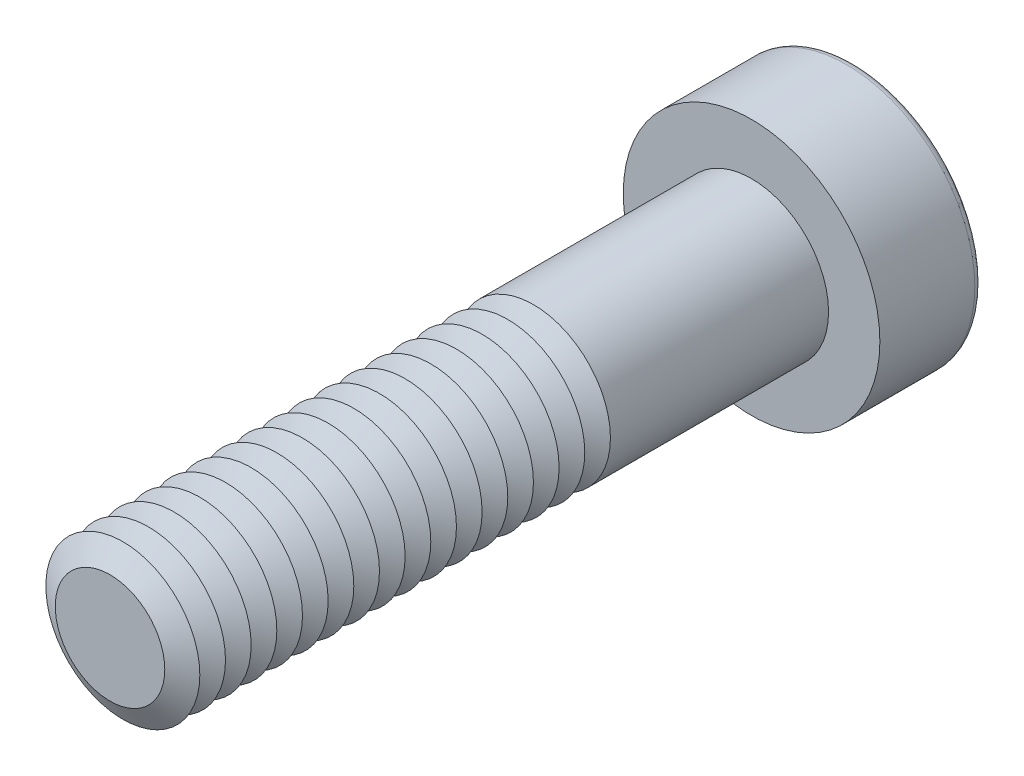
ISO-10303-21;
HEADER;
FILE_DESCRIPTION(('STEP AP214'),'2;1');
FILE_NAME('part.step','',(''),(''),'','','');
FILE_SCHEMA(('AUTOMOTIVE_DESIGN { 1 0 10303 214 1 1 1 1 }'));
ENDSEC;
DATA;
#1=APPLICATION_CONTEXT('core data for automotive mechanical design processes');
#2=APPLICATION_PROTOCOL_DEFINITION('international standard','automotive_design',2000,#1);
#3=PRODUCT_CONTEXT('',#1,'mechanical');
#4=PRODUCT('Part','Part','',(#3));
#5=PRODUCT_RELATED_PRODUCT_CATEGORY('part','',(#4));
#6=PRODUCT_DEFINITION_FORMATION('','',#4);
#7=PRODUCT_DEFINITION_CONTEXT('part definition',#1,'design');
#8=PRODUCT_DEFINITION('design','',#6,#7);
#9=PRODUCT_DEFINITION_SHAPE('','',#8);
#10=(LENGTH_UNIT() NAMED_UNIT(*) SI_UNIT(.MILLI.,.METRE.));
#11=(NAMED_UNIT(*) PLANE_ANGLE_UNIT() SI_UNIT($,.RADIAN.));
#12=(NAMED_UNIT(*) SI_UNIT($,.STERADIAN.) SOLID_ANGLE_UNIT());
#13=UNCERTAINTY_MEASURE_WITH_UNIT(LENGTH_MEASURE(1.E-05),#10,'distance_accuracy_value','');
#14=(GEOMETRIC_REPRESENTATION_CONTEXT(3) GLOBAL_UNCERTAINTY_ASSIGNED_CONTEXT((#13)) GLOBAL_UNIT_ASSIGNED_CONTEXT((#10,
#11,#12)) REPRESENTATION_CONTEXT('',''));
#15=CARTESIAN_POINT('',(0.,0.,0.));
#16=DIRECTION('',(0.,0.,1.));
#17=DIRECTION('',(1.,0.,0.));
#18=AXIS2_PLACEMENT_3D('',#15,#16,#17);
#19=CARTESIAN_POINT('',(0.,0.,21.5));
#20=DIRECTION('',(0.,0.,1.));
#21=DIRECTION('',(1.,0.,0.));
#22=AXIS2_PLACEMENT_3D('',#19,#20,#21);
#23=CONICAL_SURFACE('',#22,3.,1.0471975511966);
#24=CARTESIAN_POINT('',(0.,0.,21.));
#25=DIRECTION('',(0.,0.,1.));
#26=DIRECTION('',(1.,0.,0.));
#27=AXIS2_PLACEMENT_3D('',#24,#25,#26);
#28=CIRCLE('',#27,2.13397459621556);
#29=CARTESIAN_POINT('',(2.13397459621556,0.,21.));
#30=VERTEX_POINT('',#29);
#31=EDGE_CURVE('E313',#30,#30,#28,.T.);
#32=ORIENTED_EDGE('',*,*,#31,.T.);
#33=EDGE_LOOP('',(#32));
#34=FACE_BOUND('',#33,.T.);
#35=CARTESIAN_POINT('',(0.,0.,21.5));
#36=DIRECTION('',(0.,0.,1.));
#37=DIRECTION('',(1.,0.,0.));
#38=AXIS2_PLACEMENT_3D('',#35,#36,#37);
#39=CIRCLE('',#38,3.);
#40=CARTESIAN_POINT('',(3.,0.,21.5));
#41=VERTEX_POINT('',#40);
#42=EDGE_CURVE('E316',#41,#41,#39,.T.);
#43=ORIENTED_EDGE('',*,*,#42,.F.);
#44=EDGE_LOOP('',(#43));
#45=FACE_BOUND('',#44,.T.);
#46=ADVANCED_FACE('F39',(#34,#45),#23,.T.);
#47=CARTESIAN_POINT('',(0.,0.,21.));
#48=DIRECTION('',(0.,0.,-1.));
#49=DIRECTION('',(-1.,0.,0.));
#50=AXIS2_PLACEMENT_3D('',#47,#48,#49);
#51=CONICAL_SURFACE('',#50,2.13397459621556,1.0471975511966);
#52=CARTESIAN_POINT('',(0.,0.,20.5));
#53=DIRECTION('',(0.,0.,1.));
#54=DIRECTION('',(1.,0.,0.));
#55=AXIS2_PLACEMENT_3D('',#52,#53,#54);
#56=CIRCLE('',#55,3.);
#57=CARTESIAN_POINT('',(3.,0.,20.5));
#58=VERTEX_POINT('',#57);
#59=EDGE_CURVE('E324',#58,#58,#56,.T.);
#60=ORIENTED_EDGE('',*,*,#59,.T.);
#61=EDGE_LOOP('',(#60));
#62=FACE_BOUND('',#61,.T.);
#63=ORIENTED_EDGE('',*,*,#31,.F.);
#64=EDGE_LOOP('',(#63));
#65=FACE_BOUND('',#64,.T.);
#66=ADVANCED_FACE('F244',(#62,#65),#51,.T.);
#67=CARTESIAN_POINT('',(0.,0.,25.));
#68=DIRECTION('',(0.,0.,1.));
#69=DIRECTION('',(1.,0.,0.));
#70=AXIS2_PLACEMENT_3D('',#67,#68,#69);
#71=PLANE('',#70);
#72=CARTESIAN_POINT('',(0.,0.,25.));
#73=DIRECTION('',(0.,0.,1.));
#74=DIRECTION('',(1.,0.,0.));
#75=AXIS2_PLACEMENT_3D('',#72,#73,#74);
#76=CIRCLE('',#75,2.13397459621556);
#77=CARTESIAN_POINT('',(2.13397459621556,0.,25.));
#78=VERTEX_POINT('',#77);
#79=EDGE_CURVE('E174',#78,#78,#76,.T.);
#80=ORIENTED_EDGE('',*,*,#79,.T.);
#81=EDGE_LOOP('',(#80));
#82=FACE_BOUND('',#81,.T.);
#83=ADVANCED_FACE('F250',(#82),#71,.T.);
#84=CARTESIAN_POINT('',(0.,0.,25.));
#85=DIRECTION('',(0.,0.,-1.));
#86=DIRECTION('',(-1.,0.,0.));
#87=AXIS2_PLACEMENT_3D('',#84,#85,#86);
#88=CONICAL_SURFACE('',#87,2.13397459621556,1.0471975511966);
#89=CARTESIAN_POINT('',(0.,0.,24.5));
#90=DIRECTION('',(0.,0.,1.));
#91=DIRECTION('',(1.,0.,0.));
#92=AXIS2_PLACEMENT_3D('',#89,#90,#91);
#93=CIRCLE('',#92,3.);
#94=CARTESIAN_POINT('',(3.,0.,24.5));
#95=VERTEX_POINT('',#94);
#96=EDGE_CURVE('E290',#95,#95,#93,.T.);
#97=ORIENTED_EDGE('',*,*,#96,.T.);
#98=EDGE_LOOP('',(#97));
#99=FACE_BOUND('',#98,.T.);
#100=ORIENTED_EDGE('',*,*,#79,.F.);
#101=EDGE_LOOP('',(#100));
#102=FACE_BOUND('',#101,.T.);
#103=ADVANCED_FACE('F198',(#99,#102),#88,.T.);
#104=CARTESIAN_POINT('',(0.,0.,24.5));
#105=DIRECTION('',(0.,0.,1.));
#106=DIRECTION('',(1.,0.,0.));
#107=AXIS2_PLACEMENT_3D('',#104,#105,#106);
#108=CONICAL_SURFACE('',#107,3.,1.0471975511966);
#109=CARTESIAN_POINT('',(0.,0.,24.));
#110=DIRECTION('',(0.,0.,1.));
#111=DIRECTION('',(1.,0.,0.));
#112=AXIS2_PLACEMENT_3D('',#109,#110,#111);
#113=CIRCLE('',#112,2.13397459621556);
#114=CARTESIAN_POINT('',(2.13397459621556,0.,24.));
#115=VERTEX_POINT('',#114);
#116=EDGE_CURVE('E287',#115,#115,#113,.T.);
#117=ORIENTED_EDGE('',*,*,#116,.T.);
#118=EDGE_LOOP('',(#117));
#119=FACE_BOUND('',#118,.T.);
#120=ORIENTED_EDGE('',*,*,#96,.F.);
#121=EDGE_LOOP('',(#120));
#122=FACE_BOUND('',#121,.T.);
#123=ADVANCED_FACE('F276',(#119,#122),#108,.T.);
#124=CARTESIAN_POINT('',(0.,0.,24.));
#125=DIRECTION('',(0.,0.,-1.));
#126=DIRECTION('',(-1.,0.,0.));
#127=AXIS2_PLACEMENT_3D('',#124,#125,#126);
#128=CONICAL_SURFACE('',#127,2.13397459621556,1.0471975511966);
#129=CARTESIAN_POINT('',(0.,0.,23.5));
#130=DIRECTION('',(0.,0.,1.));
#131=DIRECTION('',(1.,0.,0.));
#132=AXIS2_PLACEMENT_3D('',#129,#130,#131);
#133=CIRCLE('',#132,3.);
#134=CARTESIAN_POINT('',(3.,0.,23.5));
#135=VERTEX_POINT('',#134);
#136=EDGE_CURVE('E299',#135,#135,#133,.T.);
#137=ORIENTED_EDGE('',*,*,#136,.T.);
#138=EDGE_LOOP('',(#137));
#139=FACE_BOUND('',#138,.T.);
#140=ORIENTED_EDGE('',*,*,#116,.F.);
#141=EDGE_LOOP('',(#140));
#142=FACE_BOUND('',#141,.T.);
#143=ADVANCED_FACE('F273',(#139,#142),#128,.T.);
#144=CARTESIAN_POINT('',(0.,0.,23.5));
#145=DIRECTION('',(0.,0.,1.));
#146=DIRECTION('',(1.,0.,0.));
#147=AXIS2_PLACEMENT_3D('',#144,#145,#146);
#148=CONICAL_SURFACE('',#147,3.,1.0471975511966);
#149=CARTESIAN_POINT('',(0.,0.,23.));
#150=DIRECTION('',(0.,0.,1.));
#151=DIRECTION('',(1.,0.,0.));
#152=AXIS2_PLACEMENT_3D('',#149,#150,#151);
#153=CIRCLE('',#152,2.13397459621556);
#154=CARTESIAN_POINT('',(2.13397459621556,0.,23.));
#155=VERTEX_POINT('',#154);
#156=EDGE_CURVE('E292',#155,#155,#153,.T.);
#157=ORIENTED_EDGE('',*,*,#156,.T.);
#158=EDGE_LOOP('',(#157));
#159=FACE_BOUND('',#158,.T.);
#160=ORIENTED_EDGE('',*,*,#136,.F.);
#161=EDGE_LOOP('',(#160));
#162=FACE_BOUND('',#161,.T.);
#163=ADVANCED_FACE('F269',(#159,#162),#148,.T.);
#164=CARTESIAN_POINT('',(0.,0.,23.));
#165=DIRECTION('',(0.,0.,-1.));
#166=DIRECTION('',(-1.,0.,0.));
#167=AXIS2_PLACEMENT_3D('',#164,#165,#166);
#168=CONICAL_SURFACE('',#167,2.13397459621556,1.0471975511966);
#169=CARTESIAN_POINT('',(0.,0.,22.5));
#170=DIRECTION('',(0.,0.,1.));
#171=DIRECTION('',(1.,0.,0.));
#172=AXIS2_PLACEMENT_3D('',#169,#170,#171);
#173=CIRCLE('',#172,3.);
#174=CARTESIAN_POINT('',(3.,0.,22.5));
#175=VERTEX_POINT('',#174);
#176=EDGE_CURVE('E309',#175,#175,#173,.T.);
#177=ORIENTED_EDGE('',*,*,#176,.T.);
#178=EDGE_LOOP('',(#177));
#179=FACE_BOUND('',#178,.T.);
#180=ORIENTED_EDGE('',*,*,#156,.F.);
#181=EDGE_LOOP('',(#180));
#182=FACE_BOUND('',#181,.T.);
#183=ADVANCED_FACE('F265',(#179,#182),#168,.T.);
#184=CARTESIAN_POINT('',(0.,0.,22.5));
#185=DIRECTION('',(0.,0.,1.));
#186=DIRECTION('',(1.,0.,0.));
#187=AXIS2_PLACEMENT_3D('',#184,#185,#186);
#188=CONICAL_SURFACE('',#187,3.,1.0471975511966);
#189=CARTESIAN_POINT('',(0.,0.,22.));
#190=DIRECTION('',(0.,0.,1.));
#191=DIRECTION('',(1.,0.,0.));
#192=AXIS2_PLACEMENT_3D('',#189,#190,#191);
#193=CIRCLE('',#192,2.13397459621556);
#194=CARTESIAN_POINT('',(2.13397459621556,0.,22.));
#195=VERTEX_POINT('',#194);
#196=EDGE_CURVE('E305',#195,#195,#193,.T.);
#197=ORIENTED_EDGE('',*,*,#196,.T.);
#198=EDGE_LOOP('',(#197));
#199=FACE_BOUND('',#198,.T.);
#200=ORIENTED_EDGE('',*,*,#176,.F.);
#201=EDGE_LOOP('',(#200));
#202=FACE_BOUND('',#201,.T.);
#203=ADVANCED_FACE('F261',(#199,#202),#188,.T.);
#204=CARTESIAN_POINT('',(0.,0.,22.));
#205=DIRECTION('',(0.,0.,-1.));
#206=DIRECTION('',(-1.,0.,0.));
#207=AXIS2_PLACEMENT_3D('',#204,#205,#206);
#208=CONICAL_SURFACE('',#207,2.13397459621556,1.0471975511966);
#209=ORIENTED_EDGE('',*,*,#42,.T.);
#210=EDGE_LOOP('',(#209));
#211=FACE_BOUND('',#210,.T.);
#212=ORIENTED_EDGE('',*,*,#196,.F.);
#213=EDGE_LOOP('',(#212));
#214=FACE_BOUND('',#213,.T.);
#215=ADVANCED_FACE('F257',(#211,#214),#208,.T.);
#216=CARTESIAN_POINT('',(0.,0.,20.5));
#217=DIRECTION('',(0.,0.,1.));
#218=DIRECTION('',(1.,0.,0.));
#219=AXIS2_PLACEMENT_3D('',#216,#217,#218);
#220=CONICAL_SURFACE('',#219,3.,1.0471975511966);
#221=CARTESIAN_POINT('',(0.,0.,20.));
#222=DIRECTION('',(0.,0.,1.));
#223=DIRECTION('',(1.,0.,0.));
#224=AXIS2_PLACEMENT_3D('',#221,#222,#223);
#225=CIRCLE('',#224,2.13397459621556);
#226=CARTESIAN_POINT('',(2.13397459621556,0.,20.));
#227=VERTEX_POINT('',#226);
#228=EDGE_CURVE('E320',#227,#227,#225,.T.);
#229=ORIENTED_EDGE('',*,*,#228,.T.);
#230=EDGE_LOOP('',(#229));
#231=FACE_BOUND('',#230,.T.);
#232=ORIENTED_EDGE('',*,*,#59,.F.);
#233=EDGE_LOOP('',(#232));
#234=FACE_BOUND('',#233,.T.);
#235=ADVANCED_FACE('F260',(#231,#234),#220,.T.);
#236=CARTESIAN_POINT('',(0.,0.,20.));
#237=DIRECTION('',(0.,0.,-1.));
#238=DIRECTION('',(-1.,0.,0.));
#239=AXIS2_PLACEMENT_3D('',#236,#237,#238);
#240=CONICAL_SURFACE('',#239,2.13397459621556,1.0471975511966);
#241=CARTESIAN_POINT('',(0.,0.,19.5));
#242=DIRECTION('',(0.,0.,1.));
#243=DIRECTION('',(1.,0.,0.));
#244=AXIS2_PLACEMENT_3D('',#241,#242,#243);
#245=CIRCLE('',#244,3.);
#246=CARTESIAN_POINT('',(3.,0.,19.5));
#247=VERTEX_POINT('',#246);
#248=EDGE_CURVE('E331',#247,#247,#245,.T.);
#249=ORIENTED_EDGE('',*,*,#248,.T.);
#250=EDGE_LOOP('',(#249));
#251=FACE_BOUND('',#250,.T.);
#252=ORIENTED_EDGE('',*,*,#228,.F.);
#253=EDGE_LOOP('',(#252));
#254=FACE_BOUND('',#253,.T.);
#255=ADVANCED_FACE('F511',(#251,#254),#240,.T.);
#256=CARTESIAN_POINT('',(0.,0.,19.5));
#257=DIRECTION('',(0.,0.,1.));
#258=DIRECTION('',(1.,0.,0.));
#259=AXIS2_PLACEMENT_3D('',#256,#257,#258);
#260=CONICAL_SURFACE('',#259,3.,1.0471975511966);
#261=CARTESIAN_POINT('',(0.,0.,19.));
#262=DIRECTION('',(0.,0.,1.));
#263=DIRECTION('',(1.,0.,0.));
#264=AXIS2_PLACEMENT_3D('',#261,#262,#263);
#265=CIRCLE('',#264,2.13397459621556);
#266=CARTESIAN_POINT('',(2.13397459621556,0.,19.));
#267=VERTEX_POINT('',#266);
#268=EDGE_CURVE('E327',#267,#267,#265,.T.);
#269=ORIENTED_EDGE('',*,*,#268,.T.);
#270=EDGE_LOOP('',(#269));
#271=FACE_BOUND('',#270,.T.);
#272=ORIENTED_EDGE('',*,*,#248,.F.);
#273=EDGE_LOOP('',(#272));
#274=FACE_BOUND('',#273,.T.);
#275=ADVANCED_FACE('F507',(#271,#274),#260,.T.);
#276=CARTESIAN_POINT('',(0.,0.,19.));
#277=DIRECTION('',(0.,0.,-1.));
#278=DIRECTION('',(-1.,0.,0.));
#279=AXIS2_PLACEMENT_3D('',#276,#277,#278);
#280=CONICAL_SURFACE('',#279,2.13397459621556,1.0471975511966);
#281=CARTESIAN_POINT('',(0.,0.,18.5));
#282=DIRECTION('',(0.,0.,1.));
#283=DIRECTION('',(1.,0.,0.));
#284=AXIS2_PLACEMENT_3D('',#281,#282,#283);
#285=CIRCLE('',#284,3.);
#286=CARTESIAN_POINT('',(3.,0.,18.5));
#287=VERTEX_POINT('',#286);
#288=EDGE_CURVE('E339',#287,#287,#285,.T.);
#289=ORIENTED_EDGE('',*,*,#288,.T.);
#290=EDGE_LOOP('',(#289));
#291=FACE_BOUND('',#290,.T.);
#292=ORIENTED_EDGE('',*,*,#268,.F.);
#293=EDGE_LOOP('',(#292));
#294=FACE_BOUND('',#293,.T.);
#295=ADVANCED_FACE('F503',(#291,#294),#280,.T.);
#296=CARTESIAN_POINT('',(0.,0.,18.5));
#297=DIRECTION('',(0.,0.,1.));
#298=DIRECTION('',(1.,0.,0.));
#299=AXIS2_PLACEMENT_3D('',#296,#297,#298);
#300=CONICAL_SURFACE('',#299,3.,1.0471975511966);
#301=CARTESIAN_POINT('',(0.,0.,18.));
#302=DIRECTION('',(0.,0.,1.));
#303=DIRECTION('',(1.,0.,0.));
#304=AXIS2_PLACEMENT_3D('',#301,#302,#303);
#305=CIRCLE('',#304,2.13397459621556);
#306=CARTESIAN_POINT('',(2.13397459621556,0.,18.));
#307=VERTEX_POINT('',#306);
#308=EDGE_CURVE('E335',#307,#307,#305,.T.);
#309=ORIENTED_EDGE('',*,*,#308,.T.);
#310=EDGE_LOOP('',(#309));
#311=FACE_BOUND('',#310,.T.);
#312=ORIENTED_EDGE('',*,*,#288,.F.);
#313=EDGE_LOOP('',(#312));
#314=FACE_BOUND('',#313,.T.);
#315=ADVANCED_FACE('F499',(#311,#314),#300,.T.);
#316=CARTESIAN_POINT('',(0.,0.,18.));
#317=DIRECTION('',(0.,0.,-1.));
#318=DIRECTION('',(-1.,0.,0.));
#319=AXIS2_PLACEMENT_3D('',#316,#317,#318);
#320=CONICAL_SURFACE('',#319,2.13397459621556,1.0471975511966);
#321=CARTESIAN_POINT('',(0.,0.,17.5));
#322=DIRECTION('',(0.,0.,1.));
#323=DIRECTION('',(1.,0.,0.));
#324=AXIS2_PLACEMENT_3D('',#321,#322,#323);
#325=CIRCLE('',#324,3.);
#326=CARTESIAN_POINT('',(3.,0.,17.5));
#327=VERTEX_POINT('',#326);
#328=EDGE_CURVE('E347',#327,#327,#325,.T.);
#329=ORIENTED_EDGE('',*,*,#328,.T.);
#330=EDGE_LOOP('',(#329));
#331=FACE_BOUND('',#330,.T.);
#332=ORIENTED_EDGE('',*,*,#308,.F.);
#333=EDGE_LOOP('',(#332));
#334=FACE_BOUND('',#333,.T.);
#335=ADVANCED_FACE('F495',(#331,#334),#320,.T.);
#336=CARTESIAN_POINT('',(0.,0.,17.5));
#337=DIRECTION('',(0.,0.,1.));
#338=DIRECTION('',(1.,0.,0.));
#339=AXIS2_PLACEMENT_3D('',#336,#337,#338);
#340=CONICAL_SURFACE('',#339,3.,1.0471975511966);
#341=CARTESIAN_POINT('',(0.,0.,17.));
#342=DIRECTION('',(0.,0.,1.));
#343=DIRECTION('',(1.,0.,0.));
#344=AXIS2_PLACEMENT_3D('',#341,#342,#343);
#345=CIRCLE('',#344,2.13397459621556);
#346=CARTESIAN_POINT('',(2.13397459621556,0.,17.));
#347=VERTEX_POINT('',#346);
#348=EDGE_CURVE('E343',#347,#347,#345,.T.);
#349=ORIENTED_EDGE('',*,*,#348,.T.);
#350=EDGE_LOOP('',(#349));
#351=FACE_BOUND('',#350,.T.);
#352=ORIENTED_EDGE('',*,*,#328,.F.);
#353=EDGE_LOOP('',(#352));
#354=FACE_BOUND('',#353,.T.);
#355=ADVANCED_FACE('F491',(#351,#354),#340,.T.);
#356=CARTESIAN_POINT('',(0.,0.,17.));
#357=DIRECTION('',(0.,0.,-1.));
#358=DIRECTION('',(-1.,0.,0.));
#359=AXIS2_PLACEMENT_3D('',#356,#357,#358);
#360=CONICAL_SURFACE('',#359,2.13397459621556,1.0471975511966);
#361=CARTESIAN_POINT('',(0.,0.,16.5));
#362=DIRECTION('',(0.,0.,1.));
#363=DIRECTION('',(1.,0.,0.));
#364=AXIS2_PLACEMENT_3D('',#361,#362,#363);
#365=CIRCLE('',#364,3.);
#366=CARTESIAN_POINT('',(3.,0.,16.5));
#367=VERTEX_POINT('',#366);
#368=EDGE_CURVE('E355',#367,#367,#365,.T.);
#369=ORIENTED_EDGE('',*,*,#368,.T.);
#370=EDGE_LOOP('',(#369));
#371=FACE_BOUND('',#370,.T.);
#372=ORIENTED_EDGE('',*,*,#348,.F.);
#373=EDGE_LOOP('',(#372));
#374=FACE_BOUND('',#373,.T.);
#375=ADVANCED_FACE('F487',(#371,#374),#360,.T.);
#376=CARTESIAN_POINT('',(0.,0.,16.5));
#377=DIRECTION('',(0.,0.,1.));
#378=DIRECTION('',(1.,0.,0.));
#379=AXIS2_PLACEMENT_3D('',#376,#377,#378);
#380=CONICAL_SURFACE('',#379,3.,1.0471975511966);
#381=CARTESIAN_POINT('',(0.,0.,16.));
#382=DIRECTION('',(0.,0.,1.));
#383=DIRECTION('',(1.,0.,0.));
#384=AXIS2_PLACEMENT_3D('',#381,#382,#383);
#385=CIRCLE('',#384,2.13397459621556);
#386=CARTESIAN_POINT('',(2.13397459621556,0.,16.));
#387=VERTEX_POINT('',#386);
#388=EDGE_CURVE('E351',#387,#387,#385,.T.);
#389=ORIENTED_EDGE('',*,*,#388,.T.);
#390=EDGE_LOOP('',(#389));
#391=FACE_BOUND('',#390,.T.);
#392=ORIENTED_EDGE('',*,*,#368,.F.);
#393=EDGE_LOOP('',(#392));
#394=FACE_BOUND('',#393,.T.);
#395=ADVANCED_FACE('F483',(#391,#394),#380,.T.);
#396=CARTESIAN_POINT('',(0.,0.,16.));
#397=DIRECTION('',(0.,0.,-1.));
#398=DIRECTION('',(-1.,0.,0.));
#399=AXIS2_PLACEMENT_3D('',#396,#397,#398);
#400=CONICAL_SURFACE('',#399,2.13397459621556,1.0471975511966);
#401=CARTESIAN_POINT('',(0.,0.,15.5));
#402=DIRECTION('',(0.,0.,1.));
#403=DIRECTION('',(1.,0.,0.));
#404=AXIS2_PLACEMENT_3D('',#401,#402,#403);
#405=CIRCLE('',#404,3.);
#406=CARTESIAN_POINT('',(3.,0.,15.5));
#407=VERTEX_POINT('',#406);
#408=EDGE_CURVE('E363',#407,#407,#405,.T.);
#409=ORIENTED_EDGE('',*,*,#408,.T.);
#410=EDGE_LOOP('',(#409));
#411=FACE_BOUND('',#410,.T.);
#412=ORIENTED_EDGE('',*,*,#388,.F.);
#413=EDGE_LOOP('',(#412));
#414=FACE_BOUND('',#413,.T.);
#415=ADVANCED_FACE('F479',(#411,#414),#400,.T.);
#416=CARTESIAN_POINT('',(0.,0.,15.5));
#417=DIRECTION('',(0.,0.,1.));
#418=DIRECTION('',(1.,0.,0.));
#419=AXIS2_PLACEMENT_3D('',#416,#417,#418);
#420=CONICAL_SURFACE('',#419,3.,1.0471975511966);
#421=CARTESIAN_POINT('',(0.,0.,15.));
#422=DIRECTION('',(0.,0.,1.));
#423=DIRECTION('',(1.,0.,0.));
#424=AXIS2_PLACEMENT_3D('',#421,#422,#423);
#425=CIRCLE('',#424,2.13397459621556);
#426=CARTESIAN_POINT('',(2.13397459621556,0.,15.));
#427=VERTEX_POINT('',#426);
#428=EDGE_CURVE('E359',#427,#427,#425,.T.);
#429=ORIENTED_EDGE('',*,*,#428,.T.);
#430=EDGE_LOOP('',(#429));
#431=FACE_BOUND('',#430,.T.);
#432=ORIENTED_EDGE('',*,*,#408,.F.);
#433=EDGE_LOOP('',(#432));
#434=FACE_BOUND('',#433,.T.);
#435=ADVANCED_FACE('F475',(#431,#434),#420,.T.);
#436=CARTESIAN_POINT('',(0.,0.,15.));
#437=DIRECTION('',(0.,0.,-1.));
#438=DIRECTION('',(-1.,0.,0.));
#439=AXIS2_PLACEMENT_3D('',#436,#437,#438);
#440=CONICAL_SURFACE('',#439,2.13397459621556,1.0471975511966);
#441=CARTESIAN_POINT('',(0.,0.,14.5));
#442=DIRECTION('',(0.,0.,1.));
#443=DIRECTION('',(1.,0.,0.));
#444=AXIS2_PLACEMENT_3D('',#441,#442,#443);
#445=CIRCLE('',#444,3.);
#446=CARTESIAN_POINT('',(3.,0.,14.5));
#447=VERTEX_POINT('',#446);
#448=EDGE_CURVE('E371',#447,#447,#445,.T.);
#449=ORIENTED_EDGE('',*,*,#448,.T.);
#450=EDGE_LOOP('',(#449));
#451=FACE_BOUND('',#450,.T.);
#452=ORIENTED_EDGE('',*,*,#428,.F.);
#453=EDGE_LOOP('',(#452));
#454=FACE_BOUND('',#453,.T.);
#455=ADVANCED_FACE('F471',(#451,#454),#440,.T.);
#456=CARTESIAN_POINT('',(0.,0.,14.5));
#457=DIRECTION('',(0.,0.,1.));
#458=DIRECTION('',(1.,0.,0.));
#459=AXIS2_PLACEMENT_3D('',#456,#457,#458);
#460=CONICAL_SURFACE('',#459,3.,1.0471975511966);
#461=CARTESIAN_POINT('',(0.,0.,14.));
#462=DIRECTION('',(0.,0.,1.));
#463=DIRECTION('',(1.,0.,0.));
#464=AXIS2_PLACEMENT_3D('',#461,#462,#463);
#465=CIRCLE('',#464,2.13397459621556);
#466=CARTESIAN_POINT('',(2.13397459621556,0.,14.));
#467=VERTEX_POINT('',#466);
#468=EDGE_CURVE('E367',#467,#467,#465,.T.);
#469=ORIENTED_EDGE('',*,*,#468,.T.);
#470=EDGE_LOOP('',(#469));
#471=FACE_BOUND('',#470,.T.);
#472=ORIENTED_EDGE('',*,*,#448,.F.);
#473=EDGE_LOOP('',(#472));
#474=FACE_BOUND('',#473,.T.);
#475=ADVANCED_FACE('F467',(#471,#474),#460,.T.);
#476=CARTESIAN_POINT('',(0.,0.,14.));
#477=DIRECTION('',(0.,0.,-1.));
#478=DIRECTION('',(-1.,0.,0.));
#479=AXIS2_PLACEMENT_3D('',#476,#477,#478);
#480=CONICAL_SURFACE('',#479,2.13397459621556,1.0471975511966);
#481=CARTESIAN_POINT('',(0.,0.,13.5));
#482=DIRECTION('',(0.,0.,1.));
#483=DIRECTION('',(1.,0.,0.));
#484=AXIS2_PLACEMENT_3D('',#481,#482,#483);
#485=CIRCLE('',#484,3.);
#486=CARTESIAN_POINT('',(3.,0.,13.5));
#487=VERTEX_POINT('',#486);
#488=EDGE_CURVE('E379',#487,#487,#485,.T.);
#489=ORIENTED_EDGE('',*,*,#488,.T.);
#490=EDGE_LOOP('',(#489));
#491=FACE_BOUND('',#490,.T.);
#492=ORIENTED_EDGE('',*,*,#468,.F.);
#493=EDGE_LOOP('',(#492));
#494=FACE_BOUND('',#493,.T.);
#495=ADVANCED_FACE('F463',(#491,#494),#480,.T.);
#496=CARTESIAN_POINT('',(0.,0.,13.5));
#497=DIRECTION('',(0.,0.,1.));
#498=DIRECTION('',(1.,0.,0.));
#499=AXIS2_PLACEMENT_3D('',#496,#497,#498);
#500=CONICAL_SURFACE('',#499,3.,1.0471975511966);
#501=CARTESIAN_POINT('',(0.,0.,13.));
#502=DIRECTION('',(0.,0.,1.));
#503=DIRECTION('',(1.,0.,0.));
#504=AXIS2_PLACEMENT_3D('',#501,#502,#503);
#505=CIRCLE('',#504,2.13397459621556);
#506=CARTESIAN_POINT('',(2.13397459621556,0.,13.));
#507=VERTEX_POINT('',#506);
#508=EDGE_CURVE('E375',#507,#507,#505,.T.);
#509=ORIENTED_EDGE('',*,*,#508,.T.);
#510=EDGE_LOOP('',(#509));
#511=FACE_BOUND('',#510,.T.);
#512=ORIENTED_EDGE('',*,*,#488,.F.);
#513=EDGE_LOOP('',(#512));
#514=FACE_BOUND('',#513,.T.);
#515=ADVANCED_FACE('F459',(#511,#514),#500,.T.);
#516=CARTESIAN_POINT('',(0.,0.,13.));
#517=DIRECTION('',(0.,0.,-1.));
#518=DIRECTION('',(-1.,0.,0.));
#519=AXIS2_PLACEMENT_3D('',#516,#517,#518);
#520=CONICAL_SURFACE('',#519,2.13397459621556,1.0471975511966);
#521=CARTESIAN_POINT('',(0.,0.,12.5));
#522=DIRECTION('',(0.,0.,1.));
#523=DIRECTION('',(1.,0.,0.));
#524=AXIS2_PLACEMENT_3D('',#521,#522,#523);
#525=CIRCLE('',#524,3.);
#526=CARTESIAN_POINT('',(3.,0.,12.5));
#527=VERTEX_POINT('',#526);
#528=EDGE_CURVE('E386',#527,#527,#525,.T.);
#529=ORIENTED_EDGE('',*,*,#528,.T.);
#530=EDGE_LOOP('',(#529));
#531=FACE_BOUND('',#530,.T.);
#532=ORIENTED_EDGE('',*,*,#508,.F.);
#533=EDGE_LOOP('',(#532));
#534=FACE_BOUND('',#533,.T.);
#535=ADVANCED_FACE('F455',(#531,#534),#520,.T.);
#536=CARTESIAN_POINT('',(0.,0.,12.5));
#537=DIRECTION('',(0.,0.,1.));
#538=DIRECTION('',(1.,0.,0.));
#539=AXIS2_PLACEMENT_3D('',#536,#537,#538);
#540=CONICAL_SURFACE('',#539,3.,1.0471975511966);
#541=CARTESIAN_POINT('',(0.,0.,12.));
#542=DIRECTION('',(0.,0.,1.));
#543=DIRECTION('',(1.,0.,0.));
#544=AXIS2_PLACEMENT_3D('',#541,#542,#543);
#545=CIRCLE('',#544,2.13397459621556);
#546=CARTESIAN_POINT('',(2.13397459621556,0.,12.));
#547=VERTEX_POINT('',#546);
#548=EDGE_CURVE('E383',#547,#547,#545,.T.);
#549=ORIENTED_EDGE('',*,*,#548,.T.);
#550=EDGE_LOOP('',(#549));
#551=FACE_BOUND('',#550,.T.);
#552=ORIENTED_EDGE('',*,*,#528,.F.);
#553=EDGE_LOOP('',(#552));
#554=FACE_BOUND('',#553,.T.);
#555=ADVANCED_FACE('F451',(#551,#554),#540,.T.);
#556=CARTESIAN_POINT('',(0.,0.,12.));
#557=DIRECTION('',(0.,0.,-1.));
#558=DIRECTION('',(-1.,0.,0.));
#559=AXIS2_PLACEMENT_3D('',#556,#557,#558);
#560=CONICAL_SURFACE('',#559,2.13397459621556,1.0471975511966);
#561=CARTESIAN_POINT('',(0.,0.,11.5));
#562=DIRECTION('',(0.,0.,1.));
#563=DIRECTION('',(1.,0.,0.));
#564=AXIS2_PLACEMENT_3D('',#561,#562,#563);
#565=CIRCLE('',#564,3.);
#566=CARTESIAN_POINT('',(3.,0.,11.5));
#567=VERTEX_POINT('',#566);
#568=EDGE_CURVE('E394',#567,#567,#565,.T.);
#569=ORIENTED_EDGE('',*,*,#568,.T.);
#570=EDGE_LOOP('',(#569));
#571=FACE_BOUND('',#570,.T.);
#572=ORIENTED_EDGE('',*,*,#548,.F.);
#573=EDGE_LOOP('',(#572));
#574=FACE_BOUND('',#573,.T.);
#575=ADVANCED_FACE('F447',(#571,#574),#560,.T.);
#576=CARTESIAN_POINT('',(0.,0.,11.5));
#577=DIRECTION('',(0.,0.,1.));
#578=DIRECTION('',(1.,0.,0.));
#579=AXIS2_PLACEMENT_3D('',#576,#577,#578);
#580=CONICAL_SURFACE('',#579,3.,1.0471975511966);
#581=CARTESIAN_POINT('',(0.,0.,11.));
#582=DIRECTION('',(0.,0.,1.));
#583=DIRECTION('',(1.,0.,0.));
#584=AXIS2_PLACEMENT_3D('',#581,#582,#583);
#585=CIRCLE('',#584,2.13397459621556);
#586=CARTESIAN_POINT('',(2.13397459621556,0.,11.));
#587=VERTEX_POINT('',#586);
#588=EDGE_CURVE('E390',#587,#587,#585,.T.);
#589=ORIENTED_EDGE('',*,*,#588,.T.);
#590=EDGE_LOOP('',(#589));
#591=FACE_BOUND('',#590,.T.);
#592=ORIENTED_EDGE('',*,*,#568,.F.);
#593=EDGE_LOOP('',(#592));
#594=FACE_BOUND('',#593,.T.);
#595=ADVANCED_FACE('F443',(#591,#594),#580,.T.);
#596=CARTESIAN_POINT('',(0.,0.,11.));
#597=DIRECTION('',(0.,0.,-1.));
#598=DIRECTION('',(-1.,0.,0.));
#599=AXIS2_PLACEMENT_3D('',#596,#597,#598);
#600=CONICAL_SURFACE('',#599,2.13397459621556,1.0471975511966);
#601=CARTESIAN_POINT('',(0.,0.,10.5));
#602=DIRECTION('',(0.,0.,1.));
#603=DIRECTION('',(1.,0.,0.));
#604=AXIS2_PLACEMENT_3D('',#601,#602,#603);
#605=CIRCLE('',#604,3.);
#606=CARTESIAN_POINT('',(3.,0.,10.5));
#607=VERTEX_POINT('',#606);
#608=EDGE_CURVE('E402',#607,#607,#605,.T.);
#609=ORIENTED_EDGE('',*,*,#608,.T.);
#610=EDGE_LOOP('',(#609));
#611=FACE_BOUND('',#610,.T.);
#612=ORIENTED_EDGE('',*,*,#588,.F.);
#613=EDGE_LOOP('',(#612));
#614=FACE_BOUND('',#613,.T.);
#615=ADVANCED_FACE('F439',(#611,#614),#600,.T.);
#616=CARTESIAN_POINT('',(0.,0.,10.5));
#617=DIRECTION('',(0.,0.,1.));
#618=DIRECTION('',(1.,0.,0.));
#619=AXIS2_PLACEMENT_3D('',#616,#617,#618);
#620=CONICAL_SURFACE('',#619,3.,1.0471975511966);
#621=CARTESIAN_POINT('',(0.,0.,10.));
#622=DIRECTION('',(0.,0.,1.));
#623=DIRECTION('',(1.,0.,0.));
#624=AXIS2_PLACEMENT_3D('',#621,#622,#623);
#625=CIRCLE('',#624,2.13397459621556);
#626=CARTESIAN_POINT('',(2.13397459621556,0.,10.));
#627=VERTEX_POINT('',#626);
#628=EDGE_CURVE('E398',#627,#627,#625,.T.);
#629=ORIENTED_EDGE('',*,*,#628,.T.);
#630=EDGE_LOOP('',(#629));
#631=FACE_BOUND('',#630,.T.);
#632=ORIENTED_EDGE('',*,*,#608,.F.);
#633=EDGE_LOOP('',(#632));
#634=FACE_BOUND('',#633,.T.);
#635=ADVANCED_FACE('F434',(#631,#634),#620,.T.);
#636=CARTESIAN_POINT('',(0.,0.,10.));
#637=DIRECTION('',(0.,0.,-1.));
#638=DIRECTION('',(-1.,0.,0.));
#639=AXIS2_PLACEMENT_3D('',#636,#637,#638);
#640=CONICAL_SURFACE('',#639,2.13397459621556,1.0471975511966);
#641=CARTESIAN_POINT('',(0.,0.,9.5));
#642=DIRECTION('',(0.,0.,1.));
#643=DIRECTION('',(1.,0.,0.));
#644=AXIS2_PLACEMENT_3D('',#641,#642,#643);
#645=CIRCLE('',#644,3.);
#646=CARTESIAN_POINT('',(3.,0.,9.5));
#647=VERTEX_POINT('',#646);
#648=EDGE_CURVE('E414',#647,#647,#645,.T.);
#649=ORIENTED_EDGE('',*,*,#648,.T.);
#650=EDGE_LOOP('',(#649));
#651=FACE_BOUND('',#650,.T.);
#652=ORIENTED_EDGE('',*,*,#628,.F.);
#653=EDGE_LOOP('',(#652));
#654=FACE_BOUND('',#653,.T.);
#655=ADVANCED_FACE('F420',(#651,#654),#640,.T.);
#656=CARTESIAN_POINT('',(0.,0.,9.5));
#657=DIRECTION('',(0.,0.,1.));
#658=DIRECTION('',(1.,0.,0.));
#659=AXIS2_PLACEMENT_3D('',#656,#657,#658);
#660=CONICAL_SURFACE('',#659,3.,1.0471975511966);
#661=CARTESIAN_POINT('',(0.,0.,9.));
#662=DIRECTION('',(0.,0.,1.));
#663=DIRECTION('',(1.,0.,0.));
#664=AXIS2_PLACEMENT_3D('',#661,#662,#663);
#665=CIRCLE('',#664,2.13397459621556);
#666=CARTESIAN_POINT('',(2.13397459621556,0.,9.));
#667=VERTEX_POINT('',#666);
#668=EDGE_CURVE('E406',#667,#667,#665,.T.);
#669=ORIENTED_EDGE('',*,*,#668,.T.);
#670=EDGE_LOOP('',(#669));
#671=FACE_BOUND('',#670,.T.);
#672=ORIENTED_EDGE('',*,*,#648,.F.);
#673=EDGE_LOOP('',(#672));
#674=FACE_BOUND('',#673,.T.);
#675=ADVANCED_FACE('F423',(#671,#674),#660,.T.);
#676=CARTESIAN_POINT('',(0.,0.,9.));
#677=DIRECTION('',(0.,0.,-1.));
#678=DIRECTION('',(-1.,0.,0.));
#679=AXIS2_PLACEMENT_3D('',#676,#677,#678);
#680=CONICAL_SURFACE('',#679,2.13397459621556,1.0471975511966);
#681=CARTESIAN_POINT('',(0.,0.,8.5));
#682=DIRECTION('',(0.,0.,1.));
#683=DIRECTION('',(1.,0.,0.));
#684=AXIS2_PLACEMENT_3D('',#681,#682,#683);
#685=CIRCLE('',#684,3.);
#686=CARTESIAN_POINT('',(3.,0.,8.5));
#687=VERTEX_POINT('',#686);
#688=EDGE_CURVE('E410',#687,#687,#685,.T.);
#689=ORIENTED_EDGE('',*,*,#688,.T.);
#690=EDGE_LOOP('',(#689));
#691=FACE_BOUND('',#690,.T.);
#692=ORIENTED_EDGE('',*,*,#668,.F.);
#693=EDGE_LOOP('',(#692));
#694=FACE_BOUND('',#693,.T.);
#695=ADVANCED_FACE('F425',(#691,#694),#680,.T.);
#696=CARTESIAN_POINT('',(0.,0.,-1.));
#697=DIRECTION('',(0.,0.,-1.));
#698=DIRECTION('',(-1.,0.,0.));
#699=AXIS2_PLACEMENT_3D('',#696,#697,#698);
#700=CONICAL_SURFACE('',#699,2.,1.0471975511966);
#701=CARTESIAN_POINT('',(0.,0.,0.154700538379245));
#702=VERTEX_POINT('',#701);
#703=VERTEX_LOOP('',#702);
#704=FACE_BOUND('',#703,.T.);
#705=CARTESIAN_POINT('',(0.,0.,-1.));
#706=DIRECTION('',(0.,0.,-1.));
#707=DIRECTION('',(-1.,0.,0.));
#708=AXIS2_PLACEMENT_3D('',#705,#706,#707);
#709=CIRCLE('',#708,2.);
#710=CARTESIAN_POINT('',(-1.73205080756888,0.999999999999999,-1.));
#711=VERTEX_POINT('',#710);
#712=CARTESIAN_POINT('',(0.,2.,-1.));
#713=VERTEX_POINT('',#712);
#714=EDGE_CURVE('E149',#711,#713,#709,.T.);
#715=ORIENTED_EDGE('',*,*,#714,.T.);
#716=CARTESIAN_POINT('',(0.,0.,-1.));
#717=DIRECTION('',(0.,0.,-1.));
#718=DIRECTION('',(-1.,0.,0.));
#719=AXIS2_PLACEMENT_3D('',#716,#717,#718);
#720=CIRCLE('',#719,2.);
#721=CARTESIAN_POINT('',(1.73205080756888,1.,-1.));
#722=VERTEX_POINT('',#721);
#723=EDGE_CURVE('E54',#713,#722,#720,.T.);
#724=ORIENTED_EDGE('',*,*,#723,.T.);
#725=CARTESIAN_POINT('',(1.73205080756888,-0.999999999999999,-1.));
#726=VERTEX_POINT('',#725);
#727=EDGE_CURVE('E1027',#722,#726,#720,.T.);
#728=ORIENTED_EDGE('',*,*,#727,.T.);
#729=CARTESIAN_POINT('',(0.,-2.,-1.));
#730=VERTEX_POINT('',#729);
#731=EDGE_CURVE('E1025',#726,#730,#720,.T.);
#732=ORIENTED_EDGE('',*,*,#731,.T.);
#733=CARTESIAN_POINT('',(-1.73205080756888,-0.999999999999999,-1.));
#734=VERTEX_POINT('',#733);
#735=EDGE_CURVE('E1018',#730,#734,#720,.T.);
#736=ORIENTED_EDGE('',*,*,#735,.T.);
#737=EDGE_CURVE('E1016',#734,#711,#720,.T.);
#738=ORIENTED_EDGE('',*,*,#737,.T.);
#739=EDGE_LOOP('',(#715,#724,#728,#732,#736,#738));
#740=FACE_BOUND('',#739,.T.);
#741=ADVANCED_FACE('F200',(#704,#740),#700,.F.);
#742=CARTESIAN_POINT('',(0.,0.,-1.));
#743=DIRECTION('',(0.,0.,-1.));
#744=DIRECTION('',(-1.,0.,0.));
#745=AXIS2_PLACEMENT_3D('',#742,#743,#744);
#746=PLANE('',#745);
#747=ORIENTED_EDGE('',*,*,#723,.F.);
#748=DIRECTION('',(1.,0.,0.));
#749=VECTOR('',#748,1.);
#750=CARTESIAN_POINT('',(-1.15470053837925,2.,-1.));
#751=LINE('',#750,#749);
#752=CARTESIAN_POINT('',(1.15470053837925,2.,-1.));
#753=VERTEX_POINT('',#752);
#754=EDGE_CURVE('E1065',#713,#753,#751,.T.);
#755=ORIENTED_EDGE('',*,*,#754,.T.);
#756=DIRECTION('',(0.5,-0.866025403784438,0.));
#757=VECTOR('',#756,1.);
#758=CARTESIAN_POINT('',(1.15470053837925,2.,-1.));
#759=LINE('',#758,#757);
#760=EDGE_CURVE('E155',#753,#722,#759,.T.);
#761=ORIENTED_EDGE('',*,*,#760,.T.);
#762=EDGE_LOOP('',(#747,#755,#761));
#763=FACE_BOUND('',#762,.T.);
#764=ADVANCED_FACE('F606',(#763),#746,.T.);
#765=ORIENTED_EDGE('',*,*,#727,.F.);
#766=CARTESIAN_POINT('',(2.3094010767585,0.,-1.));
#767=VERTEX_POINT('',#766);
#768=EDGE_CURVE('E1068',#722,#767,#759,.T.);
#769=ORIENTED_EDGE('',*,*,#768,.T.);
#770=DIRECTION('',(-0.5,-0.866025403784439,0.));
#771=VECTOR('',#770,1.);
#772=CARTESIAN_POINT('',(2.3094010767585,0.,-1.));
#773=LINE('',#772,#771);
#774=EDGE_CURVE('E1038',#767,#726,#773,.T.);
#775=ORIENTED_EDGE('',*,*,#774,.T.);
#776=EDGE_LOOP('',(#765,#769,#775));
#777=FACE_BOUND('',#776,.T.);
#778=ADVANCED_FACE('F616',(#777),#746,.T.);
#779=ORIENTED_EDGE('',*,*,#731,.F.);
#780=CARTESIAN_POINT('',(1.15470053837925,-2.,-1.));
#781=VERTEX_POINT('',#780);
#782=EDGE_CURVE('E1040',#726,#781,#773,.T.);
#783=ORIENTED_EDGE('',*,*,#782,.T.);
#784=DIRECTION('',(-1.,0.,0.));
#785=VECTOR('',#784,1.);
#786=CARTESIAN_POINT('',(1.15470053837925,-2.,-1.));
#787=LINE('',#786,#785);
#788=EDGE_CURVE('E992',#781,#730,#787,.T.);
#789=ORIENTED_EDGE('',*,*,#788,.T.);
#790=EDGE_LOOP('',(#779,#783,#789));
#791=FACE_BOUND('',#790,.T.);
#792=ADVANCED_FACE('F626',(#791),#746,.T.);
#793=ORIENTED_EDGE('',*,*,#735,.F.);
#794=CARTESIAN_POINT('',(-1.15470053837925,-2.,-1.));
#795=VERTEX_POINT('',#794);
#796=EDGE_CURVE('E1034',#730,#795,#787,.T.);
#797=ORIENTED_EDGE('',*,*,#796,.T.);
#798=DIRECTION('',(-0.5,0.866025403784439,0.));
#799=VECTOR('',#798,1.);
#800=CARTESIAN_POINT('',(-1.15470053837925,-2.,-1.));
#801=LINE('',#800,#799);
#802=EDGE_CURVE('E1036',#795,#734,#801,.T.);
#803=ORIENTED_EDGE('',*,*,#802,.T.);
#804=EDGE_LOOP('',(#793,#797,#803));
#805=FACE_BOUND('',#804,.T.);
#806=ADVANCED_FACE('F634',(#805),#746,.T.);
#807=ORIENTED_EDGE('',*,*,#737,.F.);
#808=CARTESIAN_POINT('',(-2.3094010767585,0.,-1.));
#809=VERTEX_POINT('',#808);
#810=EDGE_CURVE('E1042',#734,#809,#801,.T.);
#811=ORIENTED_EDGE('',*,*,#810,.T.);
#812=DIRECTION('',(0.5,0.866025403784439,0.));
#813=VECTOR('',#812,1.);
#814=CARTESIAN_POINT('',(-2.3094010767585,0.,-1.));
#815=LINE('',#814,#813);
#816=EDGE_CURVE('E158',#809,#711,#815,.T.);
#817=ORIENTED_EDGE('',*,*,#816,.T.);
#818=EDGE_LOOP('',(#807,#811,#817));
#819=FACE_BOUND('',#818,.T.);
#820=ADVANCED_FACE('F230',(#819),#746,.T.);
#821=ORIENTED_EDGE('',*,*,#714,.F.);
#822=CARTESIAN_POINT('',(-1.15470053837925,2.,-1.));
#823=VERTEX_POINT('',#822);
#824=EDGE_CURVE('E1049',#711,#823,#815,.T.);
#825=ORIENTED_EDGE('',*,*,#824,.T.);
#826=EDGE_CURVE('E1063',#823,#713,#751,.T.);
#827=ORIENTED_EDGE('',*,*,#826,.T.);
#828=EDGE_LOOP('',(#821,#825,#827));
#829=FACE_BOUND('',#828,.T.);
#830=ADVANCED_FACE('F618',(#829),#746,.T.);
#831=CARTESIAN_POINT('',(-1.15470053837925,2.,-1.));
#832=DIRECTION('',(0.,1.,0.));
#833=DIRECTION('',(0.,0.,1.));
#834=AXIS2_PLACEMENT_3D('',#831,#832,#833);
#835=PLANE('',#834);
#836=DIRECTION('',(0.,0.,-1.));
#837=VECTOR('',#836,1.);
#838=CARTESIAN_POINT('',(-1.15470053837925,2.,-1.));
#839=LINE('',#838,#837);
#840=CARTESIAN_POINT('',(-1.15470053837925,2.,-4.));
#841=VERTEX_POINT('',#840);
#842=EDGE_CURVE('E147',#823,#841,#839,.T.);
#843=ORIENTED_EDGE('',*,*,#842,.T.);
#844=CARTESIAN_POINT('',(-3.01440758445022,2.,-4.35051689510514));
#845=CARTESIAN_POINT('',(-2.92409762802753,2.,-4.33035636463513));
#846=CARTESIAN_POINT('',(-2.83373054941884,2.,-4.31045254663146));
#847=CARTESIAN_POINT('',(-2.65285291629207,2.,-4.27128852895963));
#848=CARTESIAN_POINT('',(-2.562342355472,2.,-4.25202835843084));
#849=CARTESIAN_POINT('',(-2.29037985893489,2.,-4.19537300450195));
#850=CARTESIAN_POINT('',(-2.10868043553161,2.,-4.15914446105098));
#851=CARTESIAN_POINT('',(-1.74597297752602,2.,-4.09171688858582));
#852=CARTESIAN_POINT('',(-1.56497266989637,2.,-4.06047686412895));
#853=CARTESIAN_POINT('',(-1.20186568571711,2.,-4.00513826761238));
#854=CARTESIAN_POINT('',(-1.01975924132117,2.,-3.98103824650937));
#855=CARTESIAN_POINT('',(-0.744747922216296,2.,-3.9525901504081));
#856=CARTESIAN_POINT('',(-0.652245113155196,2.,-3.9443671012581));
#857=CARTESIAN_POINT('',(-0.467020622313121,2.,-3.93099406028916));
#858=CARTESIAN_POINT('',(-0.374298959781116,2.,-3.92584380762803));
#859=CARTESIAN_POINT('',(-0.188764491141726,2.,-3.91891540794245));
#860=CARTESIAN_POINT('',(-0.0959517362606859,2.,-3.91713591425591));
#861=CARTESIAN_POINT('',(0.0896753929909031,2.,-3.91705786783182));
#862=CARTESIAN_POINT('',(0.182489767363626,2.,-3.91875932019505));
#863=CARTESIAN_POINT('',(0.368369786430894,2.,-3.92554892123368));
#864=CARTESIAN_POINT('',(0.461434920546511,2.,-3.93065079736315));
#865=CARTESIAN_POINT('',(0.647346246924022,2.,-3.94395663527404));
#866=CARTESIAN_POINT('',(0.740192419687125,2.,-3.95216086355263));
#867=CARTESIAN_POINT('',(1.01841374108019,2.,-3.98081777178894));
#868=CARTESIAN_POINT('',(1.2033713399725,2.,-4.00531018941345));
#869=CARTESIAN_POINT('',(1.57694396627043,2.,-4.06236202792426));
#870=CARTESIAN_POINT('',(1.76552771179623,2.,-4.09511615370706));
#871=CARTESIAN_POINT('',(2.14178491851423,2.,-4.1655706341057));
#872=CARTESIAN_POINT('',(2.32945822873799,2.,-4.20327178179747));
#873=CARTESIAN_POINT('',(2.70417911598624,2.,-4.28188312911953));
#874=CARTESIAN_POINT('',(2.89122649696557,2.,-4.32279425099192));
#875=CARTESIAN_POINT('',(3.26484478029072,2.,-4.40674298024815));
#876=CARTESIAN_POINT('',(3.45141567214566,2.,-4.44978063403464));
#877=CARTESIAN_POINT('',(3.821938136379,2.,-4.53678178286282));
#878=CARTESIAN_POINT('',(4.00589388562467,2.,-4.58072756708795));
#879=CARTESIAN_POINT('',(4.37356350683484,2.,-4.66963526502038));
#880=CARTESIAN_POINT('',(4.55727737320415,2.,-4.71459720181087));
#881=CARTESIAN_POINT('',(4.9242660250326,2.,-4.80519833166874));
#882=CARTESIAN_POINT('',(5.10754106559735,2.,-4.85083649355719));
#883=CARTESIAN_POINT('',(5.47394280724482,2.,-4.94267693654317));
#884=CARTESIAN_POINT('',(5.65706951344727,2.,-4.98887919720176));
#885=CARTESIAN_POINT('',(5.84014583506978,2.,-5.03527803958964));
#886=B_SPLINE_CURVE_WITH_KNOTS('',3,(#844,#845,#846,#847,#848,#849,#850,#851,#852,#853,#854,
#855,#856,#857,#858,#859,#860,#861,#862,#863,#864,#865,#866,#867,#868,#869,#870,#871,#872,#873,
#874,#875,#876,#877,#878,#879,#880,#881,#882,#883,#884,#885),.UNSPECIFIED.,.F.,.F.,(4,2,2,2,2,2,
2,2,2,2,2,2,2,2,2,2,2,2,2,2,4),(0.,0.277597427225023,0.555207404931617,1.11099118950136,
1.66194208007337,2.21278108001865,2.49134108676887,2.76987744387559,3.04830249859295,
3.32672796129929,3.60628428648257,3.88586463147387,4.44532615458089,5.0194589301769,
5.59368385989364,6.16807437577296,6.74247743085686,7.30986991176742,7.87727529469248,
8.44388991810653,9.01048407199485),.UNSPECIFIED.);
#887=CARTESIAN_POINT('',(1.15470053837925,2.,-4.));
#888=VERTEX_POINT('',#887);
#889=EDGE_CURVE('E124',#841,#888,#886,.T.);
#890=ORIENTED_EDGE('',*,*,#889,.T.);
#891=DIRECTION('',(0.,0.,-1.));
#892=VECTOR('',#891,1.);
#893=CARTESIAN_POINT('',(1.15470053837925,2.,-1.));
#894=LINE('',#893,#892);
#895=EDGE_CURVE('E143',#753,#888,#894,.T.);
#896=ORIENTED_EDGE('',*,*,#895,.F.);
#897=ORIENTED_EDGE('',*,*,#754,.F.);
#898=ORIENTED_EDGE('',*,*,#826,.F.);
#899=EDGE_LOOP('',(#843,#890,#896,#897,#898));
#900=FACE_BOUND('',#899,.T.);
#901=ADVANCED_FACE('F141',(#900),#835,.F.);
#902=CARTESIAN_POINT('',(1.15470053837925,2.,-1.));
#903=DIRECTION('',(0.866025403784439,0.5,0.));
#904=DIRECTION('',(-0.5,0.866025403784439,0.));
#905=AXIS2_PLACEMENT_3D('',#902,#903,#904);
#906=PLANE('',#905);
#907=ORIENTED_EDGE('',*,*,#895,.T.);
#908=CARTESIAN_POINT('',(1.15458506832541,2.0002,-4.00003094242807));
#909=CARTESIAN_POINT('',(1.20254643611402,1.91712847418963,-3.98717294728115));
#910=CARTESIAN_POINT('',(1.25059477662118,1.83390630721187,-3.97549990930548));
#911=CARTESIAN_POINT('',(1.3468611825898,1.66716800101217,-3.95499135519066));
#912=CARTESIAN_POINT('',(1.39507930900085,1.58365175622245,-3.94615699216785));
#913=CARTESIAN_POINT('',(1.49139287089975,1.41683177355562,-3.93184164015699));
#914=CARTESIAN_POINT('',(1.53948765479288,1.33352916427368,-3.92634357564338));
#915=CARTESIAN_POINT('',(1.63573857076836,1.1668176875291,-3.91897122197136));
#916=CARTESIAN_POINT('',(1.68389468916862,1.08340884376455,-3.91709623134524));
#917=CARTESIAN_POINT('',(1.78020692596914,0.916591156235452,-3.91709623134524));
#918=CARTESIAN_POINT('',(1.82836304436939,0.833182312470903,-3.91897122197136));
#919=CARTESIAN_POINT('',(1.92461396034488,0.666470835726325,-3.92634357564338));
#920=CARTESIAN_POINT('',(1.972708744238,0.583168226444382,-3.93184164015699));
#921=CARTESIAN_POINT('',(2.06902230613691,0.416348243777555,-3.94615699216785));
#922=CARTESIAN_POINT('',(2.11724043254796,0.332831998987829,-3.95499135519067));
#923=CARTESIAN_POINT('',(2.21350683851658,0.16609369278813,-3.97549990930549));
#924=CARTESIAN_POINT('',(2.26155517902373,0.0828715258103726,-3.98717294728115));
#925=CARTESIAN_POINT('',(2.30951654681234,-0.000199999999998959,-4.00003094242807));
#926=B_SPLINE_CURVE_WITH_KNOTS('',3,(#908,#909,#910,#911,#912,#913,#914,#915,#916,#917,#918,
#919,#920,#921,#922,#923,#924,#925),.UNSPECIFIED.,.F.,.F.,(4,2,2,2,2,2,2,2,4),(0.,
0.29035724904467,0.580832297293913,0.869807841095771,1.15872743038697,1.44764701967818,
1.73662256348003,2.02709761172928,2.31745486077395),.UNSPECIFIED.);
#927=CARTESIAN_POINT('',(2.3094010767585,0.,-4.));
#928=VERTEX_POINT('',#927);
#929=EDGE_CURVE('E11',#888,#928,#926,.T.);
#930=ORIENTED_EDGE('',*,*,#929,.T.);
#931=DIRECTION('',(0.,0.,-1.));
#932=VECTOR('',#931,1.);
#933=CARTESIAN_POINT('',(2.3094010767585,0.,-1.));
#934=LINE('',#933,#932);
#935=EDGE_CURVE('E157',#767,#928,#934,.T.);
#936=ORIENTED_EDGE('',*,*,#935,.F.);
#937=ORIENTED_EDGE('',*,*,#768,.F.);
#938=ORIENTED_EDGE('',*,*,#760,.F.);
#939=EDGE_LOOP('',(#907,#930,#936,#937,#938));
#940=FACE_BOUND('',#939,.T.);
#941=ADVANCED_FACE('F152',(#940),#906,.F.);
#942=CARTESIAN_POINT('',(2.3094010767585,0.,-1.));
#943=DIRECTION('',(0.866025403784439,-0.5,0.));
#944=DIRECTION('',(0.5,0.866025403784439,0.));
#945=AXIS2_PLACEMENT_3D('',#942,#943,#944);
#946=PLANE('',#945);
#947=ORIENTED_EDGE('',*,*,#935,.T.);
#948=CARTESIAN_POINT('',(2.30951654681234,0.000200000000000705,-4.00003094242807));
#949=CARTESIAN_POINT('',(2.26155517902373,-0.0828715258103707,-3.98717294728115));
#950=CARTESIAN_POINT('',(2.21350683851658,-0.166093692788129,-3.97549990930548));
#951=CARTESIAN_POINT('',(2.11724043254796,-0.332831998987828,-3.95499135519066));
#952=CARTESIAN_POINT('',(2.06902230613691,-0.416348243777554,-3.94615699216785));
#953=CARTESIAN_POINT('',(1.972708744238,-0.583168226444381,-3.93184164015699));
#954=CARTESIAN_POINT('',(1.92461396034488,-0.666470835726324,-3.92634357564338));
#955=CARTESIAN_POINT('',(1.82836304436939,-0.833182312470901,-3.91897122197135));
#956=CARTESIAN_POINT('',(1.78020692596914,-0.91659115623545,-3.91709623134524));
#957=CARTESIAN_POINT('',(1.68389468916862,-1.08340884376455,-3.91709623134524));
#958=CARTESIAN_POINT('',(1.63573857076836,-1.1668176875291,-3.91897122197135));
#959=CARTESIAN_POINT('',(1.53948765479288,-1.33352916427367,-3.92634357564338));
#960=CARTESIAN_POINT('',(1.49139287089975,-1.41683177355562,-3.93184164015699));
#961=CARTESIAN_POINT('',(1.39507930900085,-1.58365175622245,-3.94615699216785));
#962=CARTESIAN_POINT('',(1.3468611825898,-1.66716800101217,-3.95499135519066));
#963=CARTESIAN_POINT('',(1.25059477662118,-1.83390630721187,-3.97549990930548));
#964=CARTESIAN_POINT('',(1.20254643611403,-1.91712847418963,-3.98717294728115));
#965=CARTESIAN_POINT('',(1.15458506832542,-2.0002,-4.00003094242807));
#966=B_SPLINE_CURVE_WITH_KNOTS('',3,(#948,#949,#950,#951,#952,#953,#954,#955,#956,#957,#958,
#959,#960,#961,#962,#963,#964,#965),.UNSPECIFIED.,.F.,.F.,(4,2,2,2,2,2,2,2,4),(0.,
0.290357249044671,0.580832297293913,0.869807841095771,1.15872743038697,1.44764701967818,
1.73662256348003,2.02709761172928,2.31745486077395),.UNSPECIFIED.);
#967=CARTESIAN_POINT('',(1.15470053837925,-2.,-4.));
#968=VERTEX_POINT('',#967);
#969=EDGE_CURVE('E173',#928,#968,#966,.T.);
#970=ORIENTED_EDGE('',*,*,#969,.T.);
#971=DIRECTION('',(0.,0.,-1.));
#972=VECTOR('',#971,1.);
#973=CARTESIAN_POINT('',(1.15470053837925,-2.,-1.));
#974=LINE('',#973,#972);
#975=EDGE_CURVE('E987',#781,#968,#974,.T.);
#976=ORIENTED_EDGE('',*,*,#975,.F.);
#977=ORIENTED_EDGE('',*,*,#782,.F.);
#978=ORIENTED_EDGE('',*,*,#774,.F.);
#979=EDGE_LOOP('',(#947,#970,#976,#977,#978));
#980=FACE_BOUND('',#979,.T.);
#981=ADVANCED_FACE('F190',(#980),#946,.F.);
#982=CARTESIAN_POINT('',(1.15470053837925,-2.,-1.));
#983=DIRECTION('',(0.,-1.,0.));
#984=DIRECTION('',(0.,0.,-1.));
#985=AXIS2_PLACEMENT_3D('',#982,#983,#984);
#986=PLANE('',#985);
#987=ORIENTED_EDGE('',*,*,#975,.T.);
#988=CARTESIAN_POINT('',(-3.01440758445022,-2.,-4.35051689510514));
#989=CARTESIAN_POINT('',(-2.92409762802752,-2.,-4.33035636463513));
#990=CARTESIAN_POINT('',(-2.83373054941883,-2.,-4.31045254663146));
#991=CARTESIAN_POINT('',(-2.65285291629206,-2.,-4.27128852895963));
#992=CARTESIAN_POINT('',(-2.562342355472,-2.,-4.25202835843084));
#993=CARTESIAN_POINT('',(-2.29037985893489,-2.,-4.19537300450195));
#994=CARTESIAN_POINT('',(-2.10868043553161,-2.,-4.15914446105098));
#995=CARTESIAN_POINT('',(-1.74597297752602,-2.,-4.09171688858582));
#996=CARTESIAN_POINT('',(-1.56497266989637,-2.,-4.06047686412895));
#997=CARTESIAN_POINT('',(-1.20186568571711,-2.,-4.00513826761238));
#998=CARTESIAN_POINT('',(-1.01975924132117,-2.,-3.98103824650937));
#999=CARTESIAN_POINT('',(-0.744747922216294,-2.,-3.9525901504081));
#1000=CARTESIAN_POINT('',(-0.652245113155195,-2.,-3.9443671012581));
#1001=CARTESIAN_POINT('',(-0.46702062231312,-2.,-3.93099406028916));
#1002=CARTESIAN_POINT('',(-0.374298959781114,-2.,-3.92584380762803));
#1003=CARTESIAN_POINT('',(-0.188764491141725,-2.,-3.91891540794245));
#1004=CARTESIAN_POINT('',(-0.0959517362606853,-2.,-3.91713591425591));
#1005=CARTESIAN_POINT('',(0.0896753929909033,-2.,-3.91705786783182));
#1006=CARTESIAN_POINT('',(0.182489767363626,-2.,-3.91875932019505));
#1007=CARTESIAN_POINT('',(0.368369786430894,-2.,-3.92554892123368));
#1008=CARTESIAN_POINT('',(0.461434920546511,-2.,-3.93065079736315));
#1009=CARTESIAN_POINT('',(0.647346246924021,-2.,-3.94395663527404));
#1010=CARTESIAN_POINT('',(0.740192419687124,-2.,-3.95216086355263));
#1011=CARTESIAN_POINT('',(1.01841374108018,-2.,-3.98081777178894));
#1012=CARTESIAN_POINT('',(1.2033713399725,-2.,-4.00531018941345));
#1013=CARTESIAN_POINT('',(1.57694396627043,-2.,-4.06236202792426));
#1014=CARTESIAN_POINT('',(1.76552771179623,-2.,-4.09511615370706));
#1015=CARTESIAN_POINT('',(2.14178491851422,-2.,-4.1655706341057));
#1016=CARTESIAN_POINT('',(2.32945822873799,-2.,-4.20327178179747));
#1017=CARTESIAN_POINT('',(2.70417911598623,-2.,-4.28188312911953));
#1018=CARTESIAN_POINT('',(2.89122649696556,-2.,-4.32279425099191));
#1019=CARTESIAN_POINT('',(3.26484478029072,-2.,-4.40674298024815));
#1020=CARTESIAN_POINT('',(3.45141567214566,-2.,-4.44978063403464));
#1021=CARTESIAN_POINT('',(3.821938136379,-2.,-4.53678178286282));
#1022=CARTESIAN_POINT('',(4.00589388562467,-2.,-4.58072756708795));
#1023=CARTESIAN_POINT('',(4.37356350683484,-2.,-4.66963526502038));
#1024=CARTESIAN_POINT('',(4.55727737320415,-2.,-4.71459720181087));
#1025=CARTESIAN_POINT('',(4.9242660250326,-2.,-4.80519833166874));
#1026=CARTESIAN_POINT('',(5.10754106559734,-2.,-4.85083649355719));
#1027=CARTESIAN_POINT('',(5.47394280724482,-2.,-4.94267693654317));
#1028=CARTESIAN_POINT('',(5.65706951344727,-2.,-4.98887919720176));
#1029=CARTESIAN_POINT('',(5.84014583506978,-2.,-5.03527803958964));
#1030=B_SPLINE_CURVE_WITH_KNOTS('',3,(#988,#989,#990,#991,#992,#993,#994,#995,#996,#997,#998,
#999,#1000,#1001,#1002,#1003,#1004,#1005,#1006,#1007,#1008,#1009,#1010,#1011,#1012,#1013,#1014,
#1015,#1016,#1017,#1018,#1019,#1020,#1021,#1022,#1023,#1024,#1025,#1026,#1027,#1028,#1029),
.UNSPECIFIED.,.F.,.F.,(4,2,2,2,2,2,2,2,2,2,2,2,2,2,2,2,2,2,2,2,4),(0.,0.277597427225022,
0.555207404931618,1.11099118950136,1.66194208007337,2.21278108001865,2.49134108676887,
2.76987744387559,3.04830249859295,3.32672796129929,3.60628428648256,3.88586463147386,
4.44532615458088,5.01945893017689,5.59368385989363,6.16807437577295,6.74247743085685,
7.30986991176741,7.87727529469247,8.44388991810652,9.01048407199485),.UNSPECIFIED.);
#1031=CARTESIAN_POINT('',(-1.15470053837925,-2.,-4.));
#1032=VERTEX_POINT('',#1031);
#1033=EDGE_CURVE('E183',#968,#1032,#1030,.F.);
#1034=ORIENTED_EDGE('',*,*,#1033,.T.);
#1035=DIRECTION('',(0.,0.,-1.));
#1036=VECTOR('',#1035,1.);
#1037=CARTESIAN_POINT('',(-1.15470053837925,-2.,-1.));
#1038=LINE('',#1037,#1036);
#1039=EDGE_CURVE('E994',#795,#1032,#1038,.T.);
#1040=ORIENTED_EDGE('',*,*,#1039,.F.);
#1041=ORIENTED_EDGE('',*,*,#796,.F.);
#1042=ORIENTED_EDGE('',*,*,#788,.F.);
#1043=EDGE_LOOP('',(#987,#1034,#1040,#1041,#1042));
#1044=FACE_BOUND('',#1043,.T.);
#1045=ADVANCED_FACE('F233',(#1044),#986,.F.);
#1046=CARTESIAN_POINT('',(-1.15470053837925,-2.,-1.));
#1047=DIRECTION('',(-0.866025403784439,-0.5,0.));
#1048=DIRECTION('',(0.5,-0.866025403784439,0.));
#1049=AXIS2_PLACEMENT_3D('',#1046,#1047,#1048);
#1050=PLANE('',#1049);
#1051=ORIENTED_EDGE('',*,*,#1039,.T.);
#1052=CARTESIAN_POINT('',(-1.15458506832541,-2.0002,-4.00003094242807));
#1053=CARTESIAN_POINT('',(-1.20254643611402,-1.91712847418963,-3.98717294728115));
#1054=CARTESIAN_POINT('',(-1.25059477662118,-1.83390630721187,-3.97549990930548));
#1055=CARTESIAN_POINT('',(-1.34686118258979,-1.66716800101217,-3.95499135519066));
#1056=CARTESIAN_POINT('',(-1.39507930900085,-1.58365175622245,-3.94615699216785));
#1057=CARTESIAN_POINT('',(-1.49139287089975,-1.41683177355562,-3.93184164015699));
#1058=CARTESIAN_POINT('',(-1.53948765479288,-1.33352916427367,-3.92634357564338));
#1059=CARTESIAN_POINT('',(-1.63573857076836,-1.1668176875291,-3.91897122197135));
#1060=CARTESIAN_POINT('',(-1.68389468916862,-1.08340884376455,-3.91709623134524));
#1061=CARTESIAN_POINT('',(-1.78020692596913,-0.91659115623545,-3.91709623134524));
#1062=CARTESIAN_POINT('',(-1.82836304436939,-0.833182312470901,-3.91897122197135));
#1063=CARTESIAN_POINT('',(-1.92461396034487,-0.666470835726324,-3.92634357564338));
#1064=CARTESIAN_POINT('',(-1.972708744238,-0.583168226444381,-3.93184164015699));
#1065=CARTESIAN_POINT('',(-2.0690223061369,-0.416348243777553,-3.94615699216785));
#1066=CARTESIAN_POINT('',(-2.11724043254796,-0.332831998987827,-3.95499135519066));
#1067=CARTESIAN_POINT('',(-2.21350683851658,-0.166093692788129,-3.97549990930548));
#1068=CARTESIAN_POINT('',(-2.26155517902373,-0.0828715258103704,-3.98717294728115));
#1069=CARTESIAN_POINT('',(-2.30951654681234,0.000200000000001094,-4.00003094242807));
#1070=B_SPLINE_CURVE_WITH_KNOTS('',3,(#1052,#1053,#1054,#1055,#1056,#1057,#1058,#1059,#1060,
#1061,#1062,#1063,#1064,#1065,#1066,#1067,#1068,#1069),.UNSPECIFIED.,.F.,.F.,(4,2,2,2,2,2,2,2,
4),(0.,0.290357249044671,0.580832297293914,0.869807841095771,1.15872743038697,1.44764701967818,
1.73662256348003,2.02709761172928,2.31745486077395),.UNSPECIFIED.);
#1071=CARTESIAN_POINT('',(-2.3094010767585,0.,-4.));
#1072=VERTEX_POINT('',#1071);
#1073=EDGE_CURVE('E207',#1032,#1072,#1070,.T.);
#1074=ORIENTED_EDGE('',*,*,#1073,.T.);
#1075=DIRECTION('',(0.,0.,-1.));
#1076=VECTOR('',#1075,1.);
#1077=CARTESIAN_POINT('',(-2.3094010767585,0.,-1.));
#1078=LINE('',#1077,#1076);
#1079=EDGE_CURVE('E997',#809,#1072,#1078,.T.);
#1080=ORIENTED_EDGE('',*,*,#1079,.F.);
#1081=ORIENTED_EDGE('',*,*,#810,.F.);
#1082=ORIENTED_EDGE('',*,*,#802,.F.);
#1083=EDGE_LOOP('',(#1051,#1074,#1080,#1081,#1082));
#1084=FACE_BOUND('',#1083,.T.);
#1085=ADVANCED_FACE('F228',(#1084),#1050,.F.);
#1086=CARTESIAN_POINT('',(-2.3094010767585,0.,-1.));
#1087=DIRECTION('',(-0.866025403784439,0.5,0.));
#1088=DIRECTION('',(-0.5,-0.866025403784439,0.));
#1089=AXIS2_PLACEMENT_3D('',#1086,#1087,#1088);
#1090=PLANE('',#1089);
#1091=ORIENTED_EDGE('',*,*,#1079,.T.);
#1092=CARTESIAN_POINT('',(-2.30951654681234,-0.00019999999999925,-4.00003094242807));
#1093=CARTESIAN_POINT('',(-2.26155517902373,0.0828715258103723,-3.98717294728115));
#1094=CARTESIAN_POINT('',(-2.21350683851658,0.16609369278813,-3.97549990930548));
#1095=CARTESIAN_POINT('',(-2.11724043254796,0.332831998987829,-3.95499135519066));
#1096=CARTESIAN_POINT('',(-2.0690223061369,0.416348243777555,-3.94615699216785));
#1097=CARTESIAN_POINT('',(-1.972708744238,0.583168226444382,-3.93184164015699));
#1098=CARTESIAN_POINT('',(-1.92461396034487,0.666470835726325,-3.92634357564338));
#1099=CARTESIAN_POINT('',(-1.82836304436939,0.833182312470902,-3.91897122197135));
#1100=CARTESIAN_POINT('',(-1.78020692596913,0.916591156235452,-3.91709623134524));
#1101=CARTESIAN_POINT('',(-1.68389468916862,1.08340884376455,-3.91709623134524));
#1102=CARTESIAN_POINT('',(-1.63573857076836,1.1668176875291,-3.91897122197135));
#1103=CARTESIAN_POINT('',(-1.53948765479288,1.33352916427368,-3.92634357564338));
#1104=CARTESIAN_POINT('',(-1.49139287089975,1.41683177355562,-3.93184164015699));
#1105=CARTESIAN_POINT('',(-1.39507930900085,1.58365175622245,-3.94615699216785));
#1106=CARTESIAN_POINT('',(-1.3468611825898,1.66716800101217,-3.95499135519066));
#1107=CARTESIAN_POINT('',(-1.25059477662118,1.83390630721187,-3.97549990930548));
#1108=CARTESIAN_POINT('',(-1.20254643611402,1.91712847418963,-3.98717294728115));
#1109=CARTESIAN_POINT('',(-1.15458506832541,2.0002,-4.00003094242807));
#1110=B_SPLINE_CURVE_WITH_KNOTS('',3,(#1092,#1093,#1094,#1095,#1096,#1097,#1098,#1099,#1100,
#1101,#1102,#1103,#1104,#1105,#1106,#1107,#1108,#1109),.UNSPECIFIED.,.F.,.F.,(4,2,2,2,2,2,2,2,
4),(0.,0.29035724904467,0.580832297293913,0.869807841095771,1.15872743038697,1.44764701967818,
1.73662256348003,2.02709761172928,2.31745486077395),.UNSPECIFIED.);
#1111=EDGE_CURVE('E150',#1072,#841,#1110,.T.);
#1112=ORIENTED_EDGE('',*,*,#1111,.T.);
#1113=ORIENTED_EDGE('',*,*,#842,.F.);
#1114=ORIENTED_EDGE('',*,*,#824,.F.);
#1115=ORIENTED_EDGE('',*,*,#816,.F.);
#1116=EDGE_LOOP('',(#1091,#1112,#1113,#1114,#1115));
#1117=FACE_BOUND('',#1116,.T.);
#1118=ADVANCED_FACE('F196',(#1117),#1090,.F.);
#1119=CARTESIAN_POINT('',(0.,0.,-4.));
#1120=DIRECTION('',(0.,0.,-1.));
#1121=DIRECTION('',(-1.,0.,0.));
#1122=AXIS2_PLACEMENT_3D('',#1119,#1120,#1121);
#1123=CONICAL_SURFACE('',#1122,2.3094010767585,1.30899693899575);
#1124=CARTESIAN_POINT('',(0.,0.,-4.));
#1125=DIRECTION('',(0.,0.,-1.));
#1126=DIRECTION('',(-1.,0.,0.));
#1127=AXIS2_PLACEMENT_3D('',#1124,#1125,#1126);
#1128=CIRCLE('',#1127,2.3094010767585);
#1129=EDGE_CURVE('E120',#841,#888,#1128,.T.);
#1130=ORIENTED_EDGE('',*,*,#1129,.T.);
#1131=ORIENTED_EDGE('',*,*,#889,.F.);
#1132=EDGE_LOOP('',(#1130,#1131));
#1133=FACE_BOUND('',#1132,.T.);
#1134=ADVANCED_FACE('F122',(#1133),#1123,.F.);
#1135=EDGE_CURVE('E129',#888,#928,#1128,.T.);
#1136=ORIENTED_EDGE('',*,*,#1135,.T.);
#1137=ORIENTED_EDGE('',*,*,#929,.F.);
#1138=EDGE_LOOP('',(#1136,#1137));
#1139=FACE_BOUND('',#1138,.T.);
#1140=ADVANCED_FACE('F133',(#1139),#1123,.F.);
#1141=EDGE_CURVE('E164',#928,#968,#1128,.T.);
#1142=ORIENTED_EDGE('',*,*,#1141,.T.);
#1143=ORIENTED_EDGE('',*,*,#969,.F.);
#1144=EDGE_LOOP('',(#1142,#1143));
#1145=FACE_BOUND('',#1144,.T.);
#1146=ADVANCED_FACE('F699',(#1145),#1123,.F.);
#1147=EDGE_CURVE('E169',#968,#1032,#1128,.T.);
#1148=ORIENTED_EDGE('',*,*,#1147,.T.);
#1149=ORIENTED_EDGE('',*,*,#1033,.F.);
#1150=EDGE_LOOP('',(#1148,#1149));
#1151=FACE_BOUND('',#1150,.T.);
#1152=ADVANCED_FACE('F706',(#1151),#1123,.F.);
#1153=EDGE_CURVE('E67',#1032,#1072,#1128,.T.);
#1154=ORIENTED_EDGE('',*,*,#1153,.T.);
#1155=ORIENTED_EDGE('',*,*,#1073,.F.);
#1156=EDGE_LOOP('',(#1154,#1155));
#1157=FACE_BOUND('',#1156,.T.);
#1158=ADVANCED_FACE('F714',(#1157),#1123,.F.);
#1159=EDGE_CURVE('E60',#1072,#841,#1128,.T.);
#1160=ORIENTED_EDGE('',*,*,#1159,.T.);
#1161=ORIENTED_EDGE('',*,*,#1111,.F.);
#1162=EDGE_LOOP('',(#1160,#1161));
#1163=FACE_BOUND('',#1162,.T.);
#1164=ADVANCED_FACE('F197',(#1163),#1123,.F.);
#1165=CARTESIAN_POINT('',(0.,0.,-4.));
#1166=DIRECTION('',(0.,0.,-1.));
#1167=DIRECTION('',(-1.,0.,0.));
#1168=AXIS2_PLACEMENT_3D('',#1165,#1166,#1167);
#1169=PLANE('',#1168);
#1170=ORIENTED_EDGE('',*,*,#1159,.F.);
#1171=ORIENTED_EDGE('',*,*,#1153,.F.);
#1172=ORIENTED_EDGE('',*,*,#1147,.F.);
#1173=ORIENTED_EDGE('',*,*,#1141,.F.);
#1174=ORIENTED_EDGE('',*,*,#1135,.F.);
#1175=ORIENTED_EDGE('',*,*,#1129,.F.);
#1176=EDGE_LOOP('',(#1170,#1171,#1172,#1173,#1174,#1175));
#1177=FACE_BOUND('',#1176,.T.);
#1178=CARTESIAN_POINT('',(0.,0.,-4.));
#1179=DIRECTION('',(0.,0.,-1.));
#1180=DIRECTION('',(-1.,0.,0.));
#1181=AXIS2_PLACEMENT_3D('',#1178,#1179,#1180);
#1182=CIRCLE('',#1181,4.7);
#1183=CARTESIAN_POINT('',(-4.7,0.,-4.));
#1184=VERTEX_POINT('',#1183);
#1185=EDGE_CURVE('E1010',#1184,#1184,#1182,.T.);
#1186=ORIENTED_EDGE('',*,*,#1185,.T.);
#1187=EDGE_LOOP('',(#1186));
#1188=FACE_BOUND('',#1187,.T.);
#1189=ADVANCED_FACE('F161',(#1177,#1188),#1169,.T.);
#1190=CARTESIAN_POINT('',(0.,0.,-3.7));
#1191=DIRECTION('',(0.,0.,-1.));
#1192=DIRECTION('',(-1.,0.,0.));
#1193=AXIS2_PLACEMENT_3D('',#1190,#1191,#1192);
#1194=TOROIDAL_SURFACE('',#1193,4.7,0.3);
#1195=CARTESIAN_POINT('',(0.,0.,-3.7));
#1196=DIRECTION('',(0.,0.,-1.));
#1197=DIRECTION('',(-1.,0.,0.));
#1198=AXIS2_PLACEMENT_3D('',#1195,#1196,#1197);
#1199=CIRCLE('',#1198,5.);
#1200=CARTESIAN_POINT('',(-5.,0.,-3.7));
#1201=VERTEX_POINT('',#1200);
#1202=EDGE_CURVE('E1013',#1201,#1201,#1199,.F.);
#1203=ORIENTED_EDGE('',*,*,#1202,.F.);
#1204=EDGE_LOOP('',(#1203));
#1205=FACE_BOUND('',#1204,.T.);
#1206=ORIENTED_EDGE('',*,*,#1185,.F.);
#1207=EDGE_LOOP('',(#1206));
#1208=FACE_BOUND('',#1207,.T.);
#1209=ADVANCED_FACE('F41',(#1205,#1208),#1194,.T.);
#1210=CARTESIAN_POINT('',(0.,0.,-4.));
#1211=DIRECTION('',(0.,0.,1.));
#1212=DIRECTION('',(1.,0.,0.));
#1213=AXIS2_PLACEMENT_3D('',#1210,#1211,#1212);
#1214=CYLINDRICAL_SURFACE('',#1213,5.);
#1215=ORIENTED_EDGE('',*,*,#1202,.T.);
#1216=EDGE_LOOP('',(#1215));
#1217=FACE_BOUND('',#1216,.T.);
#1218=CARTESIAN_POINT('',(0.,0.,0.));
#1219=DIRECTION('',(0.,0.,-1.));
#1220=DIRECTION('',(-1.,0.,0.));
#1221=AXIS2_PLACEMENT_3D('',#1218,#1219,#1220);
#1222=CIRCLE('',#1221,5.);
#1223=CARTESIAN_POINT('',(-5.,0.,0.));
#1224=VERTEX_POINT('',#1223);
#1225=EDGE_CURVE('E1002',#1224,#1224,#1222,.T.);
#1226=ORIENTED_EDGE('',*,*,#1225,.T.);
#1227=EDGE_LOOP('',(#1226));
#1228=FACE_BOUND('',#1227,.T.);
#1229=ADVANCED_FACE('F738',(#1217,#1228),#1214,.T.);
#1230=CARTESIAN_POINT('',(0.,0.,0.));
#1231=DIRECTION('',(0.,0.,-1.));
#1232=DIRECTION('',(-1.,0.,0.));
#1233=AXIS2_PLACEMENT_3D('',#1230,#1231,#1232);
#1234=PLANE('',#1233);
#1235=CARTESIAN_POINT('',(0.,0.,0.));
#1236=DIRECTION('',(0.,0.,1.));
#1237=DIRECTION('',(1.,0.,0.));
#1238=AXIS2_PLACEMENT_3D('',#1235,#1236,#1237);
#1239=CIRCLE('',#1238,3.);
#1240=CARTESIAN_POINT('',(3.,0.,0.));
#1241=VERTEX_POINT('',#1240);
#1242=EDGE_CURVE('E1006',#1241,#1241,#1239,.T.);
#1243=ORIENTED_EDGE('',*,*,#1242,.F.);
#1244=EDGE_LOOP('',(#1243));
#1245=FACE_BOUND('',#1244,.T.);
#1246=ORIENTED_EDGE('',*,*,#1225,.F.);
#1247=EDGE_LOOP('',(#1246));
#1248=FACE_BOUND('',#1247,.T.);
#1249=ADVANCED_FACE('F746',(#1245,#1248),#1234,.F.);
#1250=CARTESIAN_POINT('',(0.,0.,25.));
#1251=DIRECTION('',(0.,0.,-1.));
#1252=DIRECTION('',(-1.,0.,0.));
#1253=AXIS2_PLACEMENT_3D('',#1250,#1251,#1252);
#1254=CYLINDRICAL_SURFACE('',#1253,3.);
#1255=ORIENTED_EDGE('',*,*,#1242,.T.);
#1256=EDGE_LOOP('',(#1255));
#1257=FACE_BOUND('',#1256,.T.);
#1258=ORIENTED_EDGE('',*,*,#688,.F.);
#1259=EDGE_LOOP('',(#1258));
#1260=FACE_BOUND('',#1259,.T.);
#1261=ADVANCED_FACE('F755',(#1257,#1260),#1254,.T.);
#1262=CLOSED_SHELL('',(#46,#66,#83,#103,#123,#143,#163,#183,#203,#215,#235,#255,#275,#295,#315,
#335,#355,#375,#395,#415,#435,#455,#475,#495,#515,#535,#555,#575,#595,#615,#635,#655,#675,#695,
#741,#764,#778,#792,#806,#820,#830,#901,#941,#981,#1045,#1085,#1118,#1134,#1140,#1146,#1152,
#1158,#1164,#1189,#1209,#1229,#1249,#1261));
#1263=MANIFOLD_SOLID_BREP('B2',#1262);
#1264=ADVANCED_BREP_SHAPE_REPRESENTATION('',(#18,#1263),#14);
#1265=SHAPE_DEFINITION_REPRESENTATION(#9,#1264);
ENDSEC;
END-ISO-10303-21;
